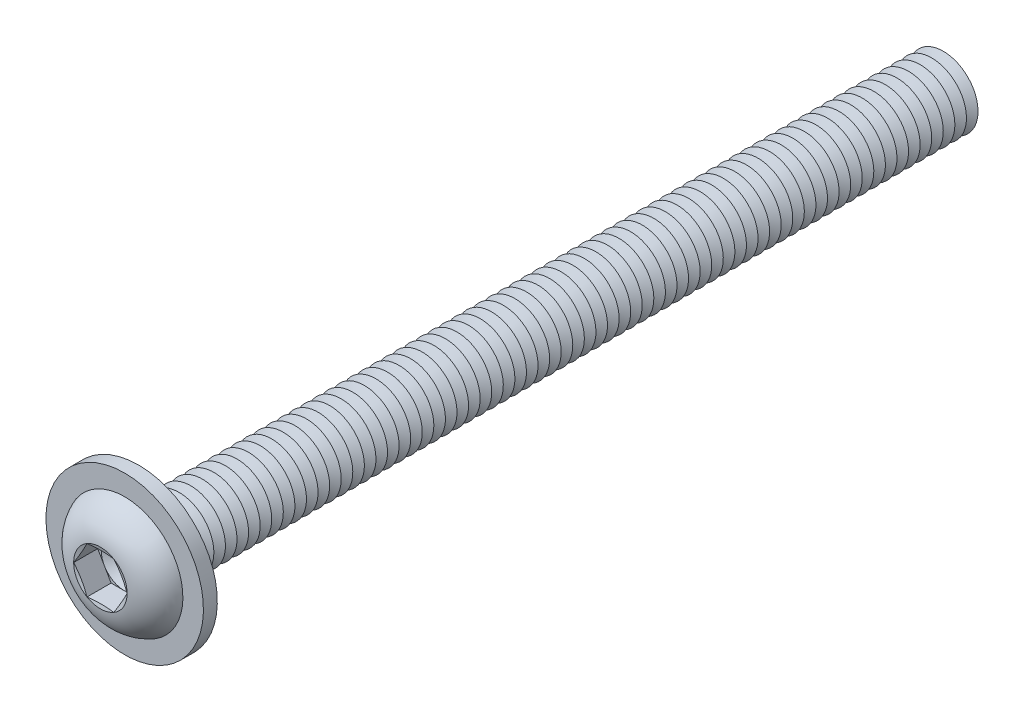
from build123d import *

# Parameters (mm, degrees)
FILLET1_R           = 0.5
LPATTERN1_COUNT     = 70
LPATTERN1_PITCH     = 1
CUT_EXTRUDE1_DEPTH  = 2.08
SKETCH5_R           = 6.8
SKETCH5_R_2         = 3.5
BOSS_EXTRUDE1_DEPTH = 1.2


with BuildPart() as part:
    # Sketch1 → Revolve1 (revolve)
    with BuildSketch(Plane(origin=(0, 0, 0), x_dir=(0, 0, -1), z_dir=(1, 0, 0))):
        with BuildLine():
            Line((0, 3), (0, 5.25))
            ThreePointArc((0, 5.25), (-2.210041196, 4.408189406), (-3.3, 2.3094))
            Line((-3.3, 2.3094), (-2.990599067, 1.1547))
            Line((-2.990599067, 1.1547), (-3.3, 1.1547))
            Line((-3.3, 1.1547), (-3.3, 0))
            Line((-3.3, 0), (70, 0))
            Line((70, 0), (70, 3))
            Line((70, 3), (0, 3))
        make_face()
    revolve(axis=Axis((0, 0, -70), (0, 0, 1)))

    # Fillet1
    fillet1_edges = [part.edges().sort_by_distance(p)[0] for p in [
        (0, -3, 0),
    ]]
    fillet(fillet1_edges, radius=FILLET1_R)

    # Sketch2 → Cut-Revolve1 (revolve, cut)
    with BuildSketch(Plane(origin=(0, 0, 0), x_dir=(0, 0, -1), z_dir=(1, 0, 0))):
        Polygon((69.5, 3), (70.5, 3), (70, 2.133974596), align=None)
    cut_revolve1 = revolve(axis=Axis((0, 0, -70), (0, 0, -1)), mode=Mode.SUBTRACT)

    # LPattern1: Cut-Revolve1 ×70
    with Locations(*[(0, 0, i * LPATTERN1_PITCH) for i in range(1, LPATTERN1_COUNT)]):
        add(cut_revolve1, mode=Mode.SUBTRACT)

    # Sketch3 → Cut-Extrude1 (cut)
    with BuildSketch(Plane.XY.offset(3.3)):
        Polygon((1.1547, 1.999999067), (-1.1547, 1.999999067), (-2.3094, 0), (-1.1547, -1.999999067), (1.1547, -1.999999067), (2.3094, 0), align=None)
    extrude(amount=-CUT_EXTRUDE1_DEPTH, mode=Mode.SUBTRACT)

    # Cut-Extrude2 cone 1 section (on through the dimple's axis) → Cut-Extrude2 (revolve, cut)
    with BuildSketch(Plane(origin=(0, 0, 1.22), x_dir=(0, -1, 0), z_dir=(1, 0, 0))):
        Polygon((0, 0), (1.999999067, 0), (0, 1.1547), align=None)
    revolve(axis=Axis((0, 0, 1.22), (0, 0, -1)), mode=Mode.SUBTRACT)

    # Sketch5 → Boss-Extrude1 (add)
    with BuildSketch(Plane(origin=(0, 0, 0), x_dir=(-1, 0, 0), z_dir=(0, 0, -1))):
        with Locations(Location((0, 0, 0), (0, 0, 90))):
            Circle(SKETCH5_R)
        Circle(SKETCH5_R_2, mode=Mode.SUBTRACT)
    extrude(amount=-BOSS_EXTRUDE1_DEPTH)


solid = part.part
